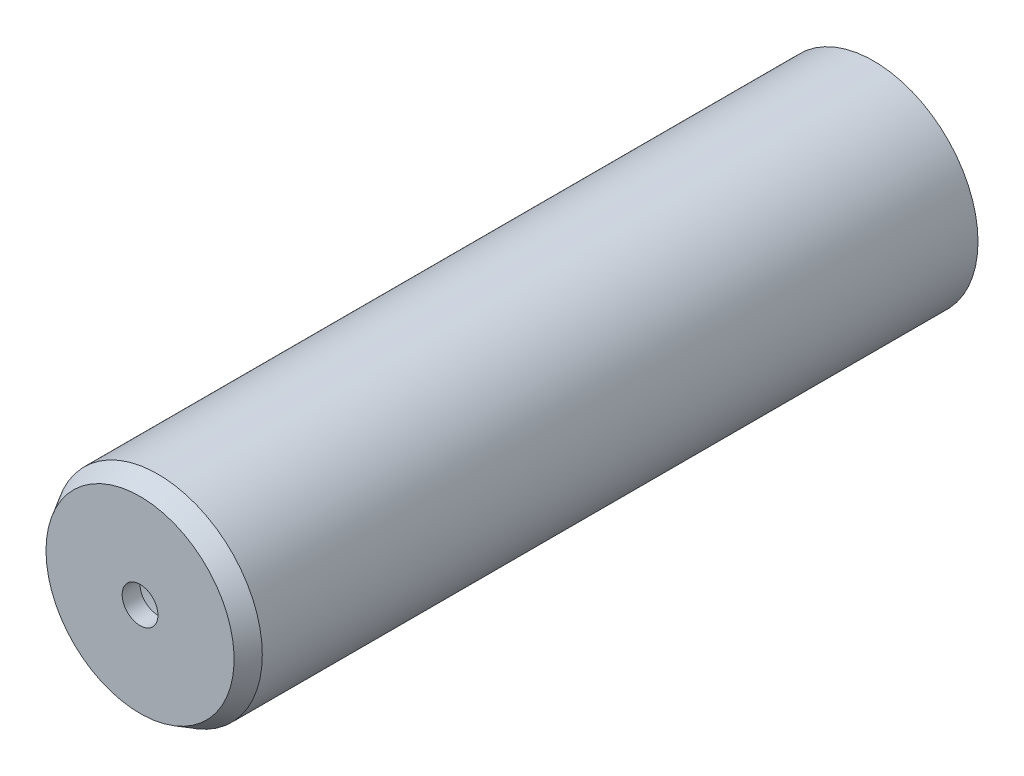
from build123d import *

# Parameters (mm, degrees)
SKETCH_2_R          = 17.5
SKETCH_2_R_2        = 15
EXTRUDE_1_DEPTH     = 120
SKETCH_3_R          = 17.5
SKETCH_3_R_2        = 3
EXTRUDE_2_DEPTH     = 3
CHAMFER_1_SIZE      = 3
CHAMFER_1_SIZE2     = 1.732050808
EXTRUDE_3_DEPTH     = 20
CHAMFER_2_SIZE      = 5
CHAMFER_2_SIZE2     = 13.737387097
CUT_EXTRUDE_1_DEPTH = 6


with BuildPart() as part:
    # Sketch 2 → Extrude 1 (new body)
    with BuildSketch(Plane.XY):
        Circle(SKETCH_2_R)
        Circle(SKETCH_2_R_2, mode=Mode.SUBTRACT)
    extrude(amount=EXTRUDE_1_DEPTH)

    # Sketch 3 → Extrude 2 (add)
    with BuildSketch(Plane.XY.offset(120)):
        Circle(SKETCH_3_R)
        Circle(SKETCH_3_R_2, mode=Mode.SUBTRACT)
    extrude(amount=EXTRUDE_2_DEPTH)

    # Chamfer 1
    chamfer_1_edges = [part.edges().sort_by_distance(p)[0] for p in [
        (-17.5, 0, 123),
    ]]
    chamfer_1_side = [part.faces().sort_by_distance(p)[0] for p in [
        (-17.5, 0, 61.5),
    ]]
    chamfer(chamfer_1_edges, length=CHAMFER_1_SIZE, length2=CHAMFER_1_SIZE2, reference=chamfer_1_side[0])

    # Sketch 5 → Extrude 3 (add)
    with BuildSketch(Plane(origin=(0, 0, 0), x_dir=(-1, 0, 0), z_dir=(0, 0, -1))):
        with BuildLine():
            Line((0, 15), (0, 10))
            Line((0, 10), (1.950175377, 9.604))
            Line((1.950175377, 9.604), (2.984962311, 14.7))
            ThreePointArc((2.984962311, 14.7), (1.5, 14.924811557), (0, 15))
        make_face()
    extrude(amount=-EXTRUDE_3_DEPTH)

    # Chamfer 2
    chamfer_2_edges = [part.edges().sort_by_distance(p)[0] for p in [
        (-0.975087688, 9.802, 20),
    ]]
    chamfer_2_side = [part.faces().sort_by_distance(p)[0] for p in [
        (-1.263910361, 12.524911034, 20),
    ]]
    chamfer(chamfer_2_edges, length=CHAMFER_2_SIZE, length2=CHAMFER_2_SIZE2, reference=chamfer_2_side[0])

    # Sketch 6 → Cut-Extrude 1 (cut)
    with BuildSketch(Plane(origin=(0, 0, 0), x_dir=(-1, 0, 0), z_dir=(0, 0, -1))):
        with BuildLine():
            Line((0, 15), (0, 10))
            Line((0, 10), (1.950175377, 9.604))
            Line((1.950175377, 9.604), (2.984962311, 14.7))
            ThreePointArc((2.984962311, 14.7), (1.5, 14.924811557), (0, 15))
        make_face()
    extrude(amount=-CUT_EXTRUDE_1_DEPTH, mode=Mode.SUBTRACT)


solid = part.part
